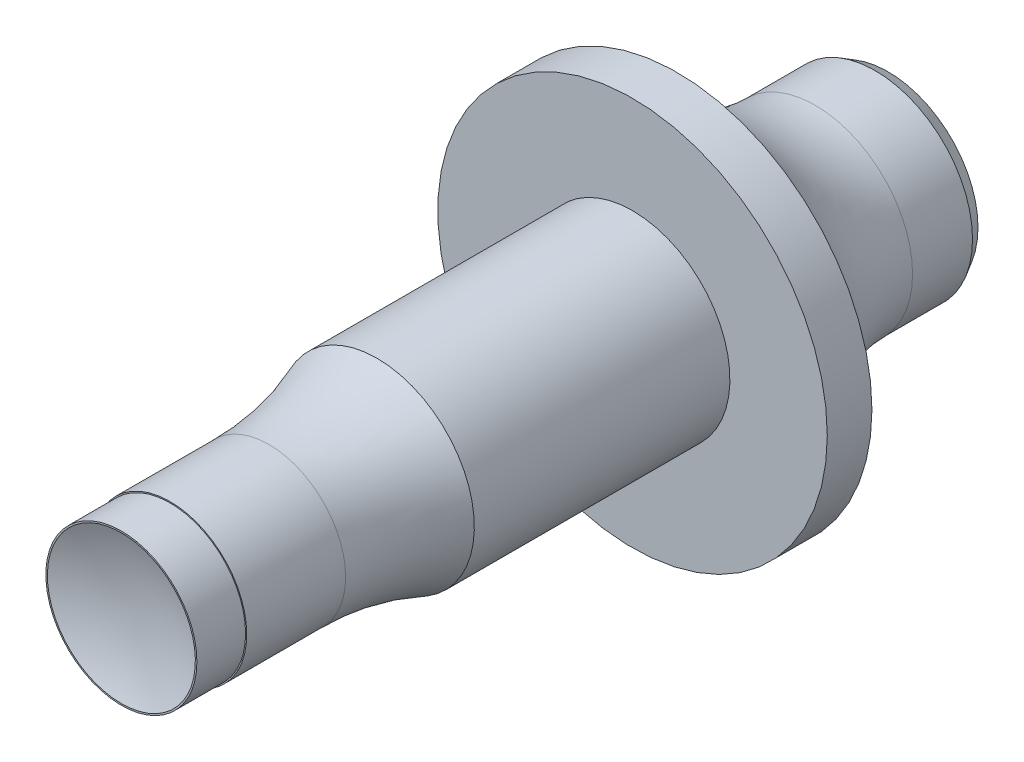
ISO-10303-21;
HEADER;
FILE_DESCRIPTION(('STEP AP214'),'2;1');
FILE_NAME('part.step','',(''),(''),'','','');
FILE_SCHEMA(('AUTOMOTIVE_DESIGN { 1 0 10303 214 1 1 1 1 }'));
ENDSEC;
DATA;
#1=APPLICATION_CONTEXT('core data for automotive mechanical design processes');
#2=APPLICATION_PROTOCOL_DEFINITION('international standard','automotive_design',2000,#1);
#3=PRODUCT_CONTEXT('',#1,'mechanical');
#4=PRODUCT('Part','Part','',(#3));
#5=PRODUCT_RELATED_PRODUCT_CATEGORY('part','',(#4));
#6=PRODUCT_DEFINITION_FORMATION('','',#4);
#7=PRODUCT_DEFINITION_CONTEXT('part definition',#1,'design');
#8=PRODUCT_DEFINITION('design','',#6,#7);
#9=PRODUCT_DEFINITION_SHAPE('','',#8);
#10=(LENGTH_UNIT() NAMED_UNIT(*) SI_UNIT(.MILLI.,.METRE.));
#11=(NAMED_UNIT(*) PLANE_ANGLE_UNIT() SI_UNIT($,.RADIAN.));
#12=(NAMED_UNIT(*) SI_UNIT($,.STERADIAN.) SOLID_ANGLE_UNIT());
#13=UNCERTAINTY_MEASURE_WITH_UNIT(LENGTH_MEASURE(1.E-05),#10,'distance_accuracy_value','');
#14=(GEOMETRIC_REPRESENTATION_CONTEXT(3) GLOBAL_UNCERTAINTY_ASSIGNED_CONTEXT((#13)) GLOBAL_UNIT_ASSIGNED_CONTEXT((#10,
#11,#12)) REPRESENTATION_CONTEXT('',''));
#15=CARTESIAN_POINT('',(0.,0.,0.));
#16=DIRECTION('',(0.,0.,1.));
#17=DIRECTION('',(1.,0.,0.));
#18=AXIS2_PLACEMENT_3D('',#15,#16,#17);
#19=CARTESIAN_POINT('',(0.,0.,-100.));
#20=DIRECTION('',(0.,0.,1.));
#21=DIRECTION('',(1.,0.,0.));
#22=AXIS2_PLACEMENT_3D('',#19,#20,#21);
#23=CYLINDRICAL_SURFACE('',#22,12.7);
#24=CARTESIAN_POINT('',(0.,0.,-33.3333333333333));
#25=DIRECTION('',(0.,0.,-1.));
#26=DIRECTION('',(0.,1.,0.));
#27=AXIS2_PLACEMENT_3D('',#24,#25,#26);
#28=CIRCLE('',#27,12.7);
#29=CARTESIAN_POINT('',(0.,12.7,-33.3333333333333));
#30=VERTEX_POINT('',#29);
#31=EDGE_CURVE('E78',#30,#30,#28,.T.);
#32=ORIENTED_EDGE('',*,*,#31,.T.);
#33=EDGE_LOOP('',(#32));
#34=FACE_BOUND('',#33,.T.);
#35=CARTESIAN_POINT('',(0.,0.,-66.6666666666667));
#36=DIRECTION('',(0.,0.,-1.));
#37=DIRECTION('',(-1.,0.,0.));
#38=AXIS2_PLACEMENT_3D('',#35,#36,#37);
#39=CIRCLE('',#38,12.7);
#40=CARTESIAN_POINT('',(-12.7,0.,-66.6666666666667));
#41=VERTEX_POINT('',#40);
#42=EDGE_CURVE('E44',#41,#41,#39,.F.);
#43=ORIENTED_EDGE('',*,*,#42,.T.);
#44=EDGE_LOOP('',(#43));
#45=FACE_BOUND('',#44,.T.);
#46=ADVANCED_FACE('F40',(#34,#45),#23,.T.);
#47=CARTESIAN_POINT('',(0.,0.,-33.3333333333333));
#48=DIRECTION('',(0.,0.,1.));
#49=DIRECTION('',(1.,0.,0.));
#50=AXIS2_PLACEMENT_3D('',#47,#48,#49);
#51=CYLINDRICAL_SURFACE('',#50,10.);
#52=CARTESIAN_POINT('',(0.,0.,-19.2461050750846));
#53=DIRECTION('',(0.,0.,1.));
#54=DIRECTION('',(0.,-1.,0.));
#55=AXIS2_PLACEMENT_3D('',#52,#53,#54);
#56=CIRCLE('',#55,10.);
#57=CARTESIAN_POINT('',(0.,-10.,-19.2461050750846));
#58=VERTEX_POINT('',#57);
#59=EDGE_CURVE('E12',#58,#58,#56,.F.);
#60=ORIENTED_EDGE('',*,*,#59,.F.);
#61=EDGE_LOOP('',(#60));
#62=FACE_BOUND('',#61,.T.);
#63=CARTESIAN_POINT('',(0.,0.,-6.35));
#64=DIRECTION('',(0.,0.,1.));
#65=DIRECTION('',(1.,0.,0.));
#66=AXIS2_PLACEMENT_3D('',#63,#64,#65);
#67=CIRCLE('',#66,10.);
#68=CARTESIAN_POINT('',(10.,0.,-6.35));
#69=VERTEX_POINT('',#68);
#70=EDGE_CURVE('E62',#69,#69,#67,.F.);
#71=ORIENTED_EDGE('',*,*,#70,.T.);
#72=EDGE_LOOP('',(#71));
#73=FACE_BOUND('',#72,.T.);
#74=ADVANCED_FACE('F105',(#62,#73),#51,.T.);
#75=CARTESIAN_POINT('',(0.,0.,-6.35));
#76=DIRECTION('',(0.,0.,1.));
#77=DIRECTION('',(1.,0.,0.));
#78=AXIS2_PLACEMENT_3D('',#75,#76,#77);
#79=PLANE('',#78);
#80=ORIENTED_EDGE('',*,*,#70,.F.);
#81=EDGE_LOOP('',(#80));
#82=FACE_BOUND('',#81,.T.);
#83=CARTESIAN_POINT('',(0.,0.,-6.35));
#84=DIRECTION('',(0.,0.,1.));
#85=DIRECTION('',(1.,0.,0.));
#86=AXIS2_PLACEMENT_3D('',#83,#84,#85);
#87=CIRCLE('',#86,9.85);
#88=CARTESIAN_POINT('',(9.85,0.,-6.35));
#89=VERTEX_POINT('',#88);
#90=EDGE_CURVE('E66',#89,#89,#87,.T.);
#91=ORIENTED_EDGE('',*,*,#90,.F.);
#92=EDGE_LOOP('',(#91));
#93=FACE_BOUND('',#92,.T.);
#94=ADVANCED_FACE('F110',(#82,#93),#79,.T.);
#95=CARTESIAN_POINT('',(0.,0.,-6.35));
#96=DIRECTION('',(0.,0.,1.));
#97=DIRECTION('',(1.,0.,0.));
#98=AXIS2_PLACEMENT_3D('',#95,#96,#97);
#99=CYLINDRICAL_SURFACE('',#98,9.85);
#100=ORIENTED_EDGE('',*,*,#90,.T.);
#101=EDGE_LOOP('',(#100));
#102=FACE_BOUND('',#101,.T.);
#103=CARTESIAN_POINT('',(0.,0.,0.));
#104=DIRECTION('',(0.,0.,1.));
#105=DIRECTION('',(1.,0.,0.));
#106=AXIS2_PLACEMENT_3D('',#103,#104,#105);
#107=CIRCLE('',#106,9.85);
#108=CARTESIAN_POINT('',(9.85,0.,0.));
#109=VERTEX_POINT('',#108);
#110=EDGE_CURVE('E67',#109,#109,#107,.T.);
#111=ORIENTED_EDGE('',*,*,#110,.F.);
#112=EDGE_LOOP('',(#111));
#113=FACE_BOUND('',#112,.T.);
#114=ADVANCED_FACE('F147',(#102,#113),#99,.T.);
#115=CARTESIAN_POINT('',(0.,0.,0.));
#116=DIRECTION('',(0.,0.,1.));
#117=DIRECTION('',(1.,0.,0.));
#118=AXIS2_PLACEMENT_3D('',#115,#116,#117);
#119=PLANE('',#118);
#120=CARTESIAN_POINT('',(0.,0.,0.));
#121=DIRECTION('',(0.,0.,1.));
#122=DIRECTION('',(0.,-1.,0.));
#123=AXIS2_PLACEMENT_3D('',#120,#121,#122);
#124=CIRCLE('',#123,9.65);
#125=CARTESIAN_POINT('',(0.,-9.65,0.));
#126=VERTEX_POINT('',#125);
#127=EDGE_CURVE('E71',#126,#126,#124,.T.);
#128=ORIENTED_EDGE('',*,*,#127,.F.);
#129=EDGE_LOOP('',(#128));
#130=FACE_BOUND('',#129,.T.);
#131=ORIENTED_EDGE('',*,*,#110,.T.);
#132=EDGE_LOOP('',(#131));
#133=FACE_BOUND('',#132,.T.);
#134=ADVANCED_FACE('F145',(#130,#133),#119,.T.);
#135=CARTESIAN_POINT('',(0.,0.,23.4954782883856));
#136=DIRECTION('',(0.,0.,1.));
#137=DIRECTION('',(0.,-1.,0.));
#138=AXIS2_PLACEMENT_3D('',#135,#136,#137);
#139=SPHERICAL_SURFACE('',#138,25.4);
#140=ORIENTED_EDGE('',*,*,#127,.T.);
#141=EDGE_LOOP('',(#140));
#142=FACE_BOUND('',#141,.T.);
#143=ADVANCED_FACE('F142',(#142),#139,.F.);
#144=CARTESIAN_POINT('',(0.,0.,-19.2461050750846));
#145=DIRECTION('',(0.,0.,-1.));
#146=DIRECTION('',(0.,1.,0.));
#147=AXIS2_PLACEMENT_3D('',#144,#145,#146);
#148=TOROIDAL_SURFACE('',#147,48.1,38.1);
#149=ORIENTED_EDGE('',*,*,#59,.T.);
#150=EDGE_LOOP('',(#149));
#151=FACE_BOUND('',#150,.T.);
#152=ORIENTED_EDGE('',*,*,#31,.F.);
#153=EDGE_LOOP('',(#152));
#154=FACE_BOUND('',#153,.T.);
#155=ADVANCED_FACE('F123',(#151,#154),#148,.F.);
#156=CARTESIAN_POINT('',(0.,0.,-66.6666666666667));
#157=DIRECTION('',(0.,0.,-1.));
#158=DIRECTION('',(-1.,0.,0.));
#159=AXIS2_PLACEMENT_3D('',#156,#157,#158);
#160=PLANE('',#159);
#161=ORIENTED_EDGE('',*,*,#42,.F.);
#162=EDGE_LOOP('',(#161));
#163=FACE_BOUND('',#162,.T.);
#164=CARTESIAN_POINT('',(0.,0.,-66.6666666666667));
#165=DIRECTION('',(0.,0.,1.));
#166=DIRECTION('',(1.,0.,0.));
#167=AXIS2_PLACEMENT_3D('',#164,#165,#166);
#168=CIRCLE('',#167,25.4);
#169=CARTESIAN_POINT('',(25.4,0.,-66.6666666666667));
#170=VERTEX_POINT('',#169);
#171=EDGE_CURVE('E82',#170,#170,#168,.T.);
#172=ORIENTED_EDGE('',*,*,#171,.T.);
#173=EDGE_LOOP('',(#172));
#174=FACE_BOUND('',#173,.T.);
#175=ADVANCED_FACE('F119',(#163,#174),#160,.F.);
#176=CARTESIAN_POINT('',(0.,0.,-66.6666666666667));
#177=DIRECTION('',(0.,0.,1.));
#178=DIRECTION('',(1.,0.,0.));
#179=AXIS2_PLACEMENT_3D('',#176,#177,#178);
#180=CYLINDRICAL_SURFACE('',#179,25.4);
#181=ORIENTED_EDGE('',*,*,#171,.F.);
#182=EDGE_LOOP('',(#181));
#183=FACE_BOUND('',#182,.T.);
#184=CARTESIAN_POINT('',(0.,0.,-72.4908338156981));
#185=DIRECTION('',(0.,0.,1.));
#186=DIRECTION('',(1.,0.,0.));
#187=AXIS2_PLACEMENT_3D('',#184,#185,#186);
#188=CIRCLE('',#187,25.4);
#189=CARTESIAN_POINT('',(25.4,0.,-72.4908338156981));
#190=VERTEX_POINT('',#189);
#191=EDGE_CURVE('E85',#190,#190,#188,.T.);
#192=ORIENTED_EDGE('',*,*,#191,.T.);
#193=EDGE_LOOP('',(#192));
#194=FACE_BOUND('',#193,.T.);
#195=ADVANCED_FACE('F122',(#183,#194),#180,.T.);
#196=CARTESIAN_POINT('',(0.,0.,-90.4866666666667));
#197=DIRECTION('',(0.,0.,1.));
#198=DIRECTION('',(1.,0.,0.));
#199=AXIS2_PLACEMENT_3D('',#196,#197,#198);
#200=TOROIDAL_SURFACE('',#199,31.8,19.1);
#201=ORIENTED_EDGE('',*,*,#191,.F.);
#202=EDGE_LOOP('',(#201));
#203=FACE_BOUND('',#202,.T.);
#204=CARTESIAN_POINT('',(0.,0.,-90.4866666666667));
#205=DIRECTION('',(0.,0.,1.));
#206=DIRECTION('',(1.,0.,0.));
#207=AXIS2_PLACEMENT_3D('',#204,#205,#206);
#208=CIRCLE('',#207,12.7);
#209=CARTESIAN_POINT('',(12.7,0.,-90.4866666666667));
#210=VERTEX_POINT('',#209);
#211=EDGE_CURVE('E88',#210,#210,#208,.T.);
#212=ORIENTED_EDGE('',*,*,#211,.T.);
#213=EDGE_LOOP('',(#212));
#214=FACE_BOUND('',#213,.T.);
#215=ADVANCED_FACE('F93',(#203,#214),#200,.F.);
#216=CARTESIAN_POINT('',(0.,0.,-100.));
#217=DIRECTION('',(0.,0.,1.));
#218=DIRECTION('',(1.,0.,0.));
#219=AXIS2_PLACEMENT_3D('',#216,#217,#218);
#220=PLANE('',#219);
#221=CARTESIAN_POINT('',(0.,0.,-100.));
#222=DIRECTION('',(0.,0.,1.));
#223=DIRECTION('',(1.,0.,0.));
#224=AXIS2_PLACEMENT_3D('',#221,#222,#223);
#225=CIRCLE('',#224,11.7223535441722);
#226=CARTESIAN_POINT('',(11.7223535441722,0.,-100.));
#227=VERTEX_POINT('',#226);
#228=EDGE_CURVE('E49',#227,#227,#225,.F.);
#229=ORIENTED_EDGE('',*,*,#228,.T.);
#230=EDGE_LOOP('',(#229));
#231=FACE_BOUND('',#230,.T.);
#232=ADVANCED_FACE('F101',(#231),#220,.F.);
#233=CARTESIAN_POINT('',(0.,0.,-98.3066666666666));
#234=DIRECTION('',(0.,0.,1.));
#235=DIRECTION('',(1.,0.,0.));
#236=AXIS2_PLACEMENT_3D('',#233,#234,#235);
#237=CONICAL_SURFACE('',#236,12.7,0.5235987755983);
#238=ORIENTED_EDGE('',*,*,#228,.F.);
#239=EDGE_LOOP('',(#238));
#240=FACE_BOUND('',#239,.T.);
#241=CARTESIAN_POINT('',(0.,0.,-98.3066666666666));
#242=DIRECTION('',(0.,0.,1.));
#243=DIRECTION('',(1.,0.,0.));
#244=AXIS2_PLACEMENT_3D('',#241,#242,#243);
#245=CIRCLE('',#244,12.7);
#246=CARTESIAN_POINT('',(12.7,0.,-98.3066666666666));
#247=VERTEX_POINT('',#246);
#248=EDGE_CURVE('E56',#247,#247,#245,.T.);
#249=ORIENTED_EDGE('',*,*,#248,.F.);
#250=EDGE_LOOP('',(#249));
#251=FACE_BOUND('',#250,.T.);
#252=ADVANCED_FACE('F42',(#240,#251),#237,.T.);
#253=ORIENTED_EDGE('',*,*,#248,.T.);
#254=EDGE_LOOP('',(#253));
#255=FACE_BOUND('',#254,.T.);
#256=ORIENTED_EDGE('',*,*,#211,.F.);
#257=EDGE_LOOP('',(#256));
#258=FACE_BOUND('',#257,.T.);
#259=ADVANCED_FACE('F95',(#255,#258),#23,.T.);
#260=CLOSED_SHELL('',(#46,#74,#94,#114,#134,#143,#155,#175,#195,#215,#232,#252,#259));
#261=MANIFOLD_SOLID_BREP('B2',#260);
#262=ADVANCED_BREP_SHAPE_REPRESENTATION('',(#18,#261),#14);
#263=SHAPE_DEFINITION_REPRESENTATION(#9,#262);
ENDSEC;
END-ISO-10303-21;
